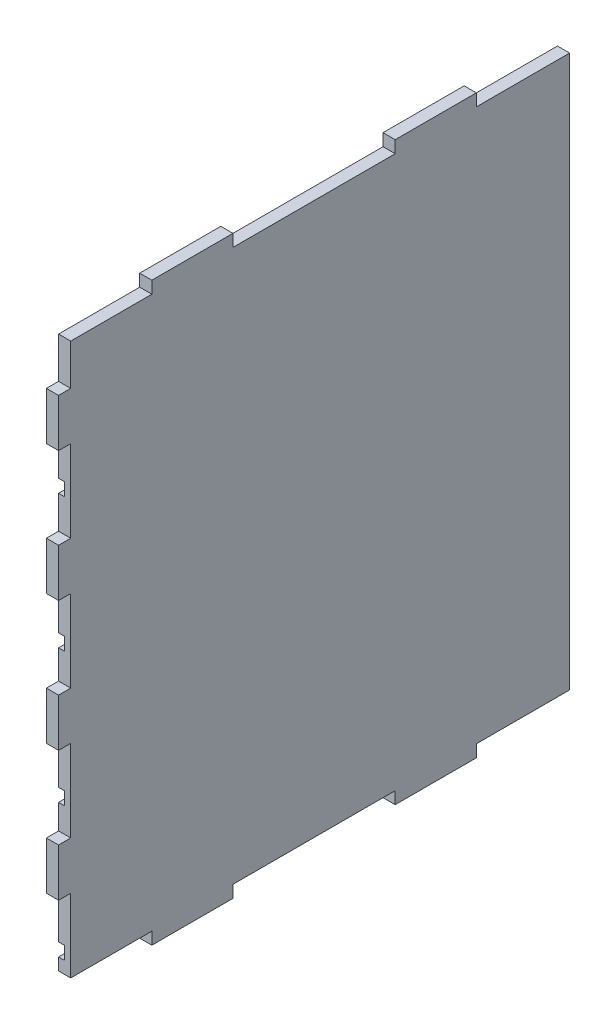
from build123d import *

# Parameters (mm, degrees)
SALIENTE_EXTRUIR1_DEPTH = 630
CROQUIS2_W              = 115
CROQUIS2_H              = 15
CROQUIS2_W_2            = 200
CORTAR_EXTRUIR1_DEPTH   = 950.328710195
CROQUIS3_W              = 15
CROQUIS3_H              = 101
CORTAR_EXTRUIR3_DEPTH   = 950.328710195


with BuildPart() as part:
    # Croquis1 → Saliente-Extruir1 (new body)
    with BuildSketch(Plane.XY):
        Polygon((0, 0), (-15, 0), (-15, 30), (-7.5, 30), (-7.5, 46), (-15, 46), (-15, 195), (-7.5, 195), (-7.5, 211), (-15, 211), (-15, 360), (-7.5, 360), (-7.5, 376), (-15, 376), (-15, 525), (-7.5, 525), (-7.5, 541), (-15, 541), (-15, 710), (0, 710), align=None)
    extrude(amount=SALIENTE_EXTRUIR1_DEPTH)

    # Croquis2 → Cortar-Extruir1 (cut, through all)
    with BuildSketch(Plane(origin=(0, 0, 0), x_dir=(0, 0, -1), z_dir=(1, 0, 0))):
        with Locations((-57.5, 7.5)):
            Rectangle(CROQUIS2_W, CROQUIS2_H)
        with Locations((-315, 7.5)):
            Rectangle(CROQUIS2_W_2, CROQUIS2_H)
        with Locations((-572.5, 7.5)):
            Rectangle(CROQUIS2_W, CROQUIS2_H)
        with Locations((-572.5, 702.5)):
            Rectangle(CROQUIS2_W, CROQUIS2_H)
        with Locations((-315, 702.5)):
            Rectangle(CROQUIS2_W_2, CROQUIS2_H)
        with Locations((-57.5, 702.5)):
            Rectangle(CROQUIS2_W, CROQUIS2_H)
    extrude(amount=-CORTAR_EXTRUIR1_DEPTH, mode=Mode.SUBTRACT)

    # Croquis3 → Cortar-Extruir3 (cut, through all)
    with BuildSketch(Plane.ZY.offset(15)):
        with Locations((622.5, 695)):
            Rectangle(CROQUIS3_W, CROQUIS3_H)
        with Locations((622.5, 535)):
            Rectangle(CROQUIS3_W, CROQUIS3_H)
        with Locations((622.5, 375)):
            Rectangle(CROQUIS3_W, CROQUIS3_H)
        with Locations((622.5, 215)):
            Rectangle(CROQUIS3_W, CROQUIS3_H)
        with Locations((622.5, 55)):
            Rectangle(CROQUIS3_W, CROQUIS3_H)
    extrude(amount=-CORTAR_EXTRUIR3_DEPTH, mode=Mode.SUBTRACT)


solid = part.part
